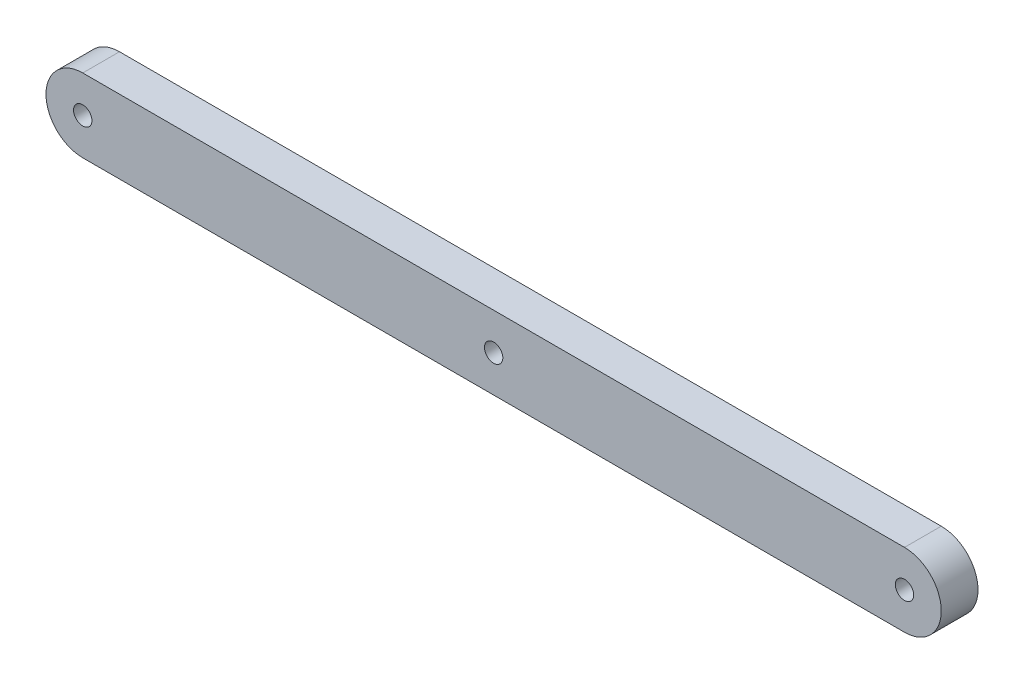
from build123d import *

# Parameters (mm, degrees)
BOSS_EXTRUDE1_DEPTH     = 2.54
SKETCH2_R               = 0.635
CUT_EXTRUDE1_DEPTH      = 60.44303343
CUT_EXTRUDE2_DEPTH      = 60.44303343
CUT_EXTRUDE2_DEPTH_BACK = 60.44303343
SKETCH3_R               = 0.635


with BuildPart() as part:
    # Sketch1 → Boss-Extrude1 (new body)
    with BuildSketch(Plane.XY):
        with BuildLine():
            Line((0, 2.54), (56.7944, 2.54))
            ThreePointArc((56.7944, 2.54), (59.3344, 0), (56.7944, -2.54))
            Line((56.7944, -2.54), (0, -2.54))
            ThreePointArc((0, -2.54), (-2.54, 0), (0, 2.54))
        make_face()
    extrude(amount=BOSS_EXTRUDE1_DEPTH)

    # Sketch2 → Cut-Extrude1 (cut, symmetric)
    with BuildSketch(Plane.XY.offset(2.54)):
        Circle(SKETCH2_R)
    cut_extrude1 = extrude(amount=CUT_EXTRUDE1_DEPTH, both=True, mode=Mode.SUBTRACT)

    # Mirror1: Cut-Extrude1 across plane
    add(cut_extrude1.mirror(Plane(origin=(28.3972, 0, 0), x_dir=(0, 0, 1), z_dir=(1, 0, 0))), mode=Mode.SUBTRACT)

    # Sketch3 → Cut-Extrude2 (cut, two sides: drawn at the far end of the back side and taken through both)
    with BuildSketch(Plane.XY.offset(2.54).offset(-CUT_EXTRUDE2_DEPTH_BACK)):
        with Locations((28.3972, 0)):
            Circle(SKETCH3_R)
    extrude(amount=CUT_EXTRUDE2_DEPTH + CUT_EXTRUDE2_DEPTH_BACK, mode=Mode.SUBTRACT)


solid = part.part
